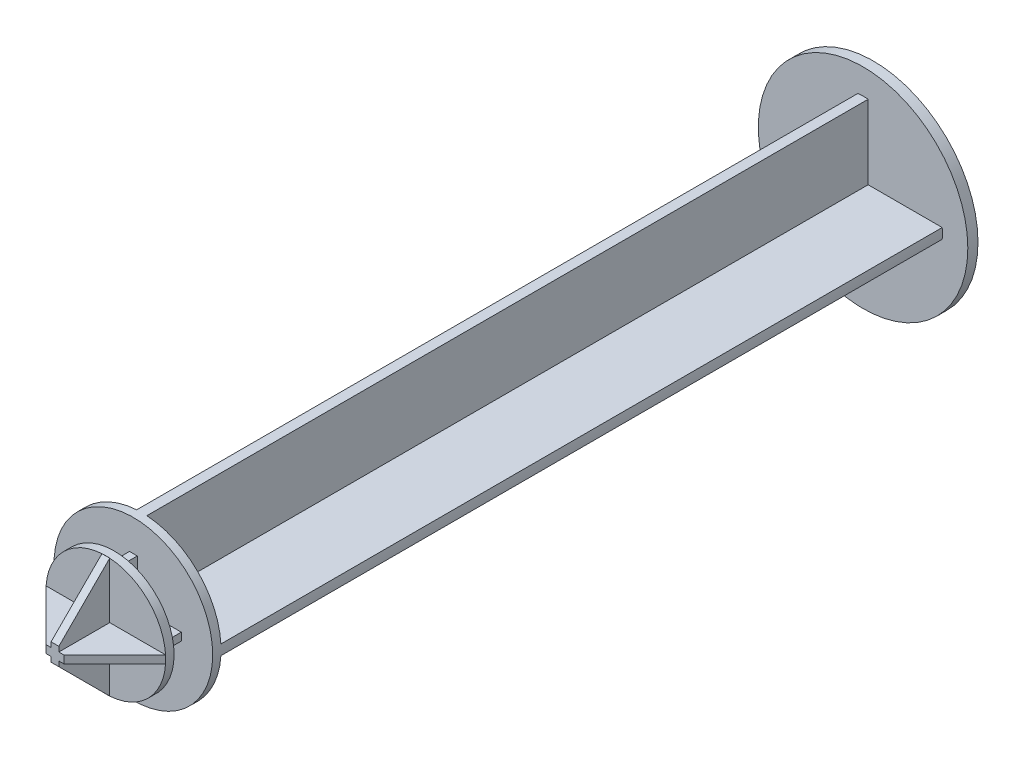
from build123d import *

# Parameters (mm, degrees)
ESQUISSE1_R    = 17.5
DISQUE_1_DEPTH = 1.7
TIGE_DEPTH     = 120.5
ESQUISSE3_R    = 13.25
DISQUE_2_DEPTH = 1.4
CROIX_1_DEPTH  = 3.2
ESQUISSE5_R    = 10
DISQUE_3_DEPTH = 1.4
CROIX_2_DEPTH  = 8.5
EMBOUT_ANGLE   = 45


with BuildPart() as part:
    # Esquisse1 → DISQUE 1 (new body)
    with BuildSketch(Plane.XY):
        Circle(ESQUISSE1_R)
    extrude(amount=DISQUE_1_DEPTH)

    # Esquisse2 → TIGE (add)
    with BuildSketch(Plane.XY.offset(1.7)):
        with BuildLine():
            Line((-0.85, 13.222707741), (-0.85, 0.85))
            Line((-0.85, 0.85), (-13.222707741, 0.85))
            ThreePointArc((-13.222707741, 0.85), (-13.25, 0), (-13.222707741, -0.85))
            Line((-13.222707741, -0.85), (-0.85, -0.85))
            Line((-0.85, -0.85), (-0.85, -13.222707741))
            ThreePointArc((-0.85, -13.222707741), (0, -13.25), (0.85, -13.222707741))
            Line((0.85, -13.222707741), (0.85, -0.85))
            Line((0.85, -0.85), (13.222707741, -0.85))
            ThreePointArc((13.222707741, -0.85), (13.25, 0), (13.222707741, 0.85))
            Line((13.222707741, 0.85), (0.85, 0.85))
            Line((0.85, 0.85), (0.85, 13.222707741))
            ThreePointArc((0.85, 13.222707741), (0, 13.25), (-0.85, 13.222707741))
        make_face()
    extrude(amount=TIGE_DEPTH)

    # Esquisse3 → DISQUE 2 (add)
    with BuildSketch(Plane.XY.offset(122.2)):
        with Locations(Location((0, 0, 0), (0, 0, 176.321895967))):
            Circle(ESQUISSE3_R)
    extrude(amount=DISQUE_2_DEPTH)

    # Esquisse4 → CROIX 1 (add)
    with BuildSketch(Plane.XY.offset(123.6)):
        Polygon((-0.65, 8), (-0.65, 0.65), (-8, 0.65), (-8, -0.65), (-0.65, -0.65), (-0.65, -8), (0.65, -8), (0.65, -0.65), (8, -0.65), (8, 0.65), (0.65, 0.65), (0.65, 8), align=None)
    extrude(amount=CROIX_1_DEPTH)

    # Esquisse5 → DISQUE 3 (add)
    with BuildSketch(Plane.XY.offset(126.8)):
        Circle(ESQUISSE5_R)
    extrude(amount=DISQUE_3_DEPTH)

    # Esquisse6 → CROIX 2 (add)
    with BuildSketch(Plane.XY.offset(128.2)):
        Polygon((-0.65, 9.978852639), (-0.65, 0.65), (-9.978852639, 0.65), (-9.978852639, -0.65), (-0.65, -0.65), (-0.65, -9.978852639), (0.65, -9.978852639), (0.65, -0.65), (9.978852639, -0.65), (9.978852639, 0.65), (0.65, 0.65), (0.65, 9.978852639), align=None)
    extrude(amount=CROIX_2_DEPTH)

    # EMBOUT
    embout_faces = [part.faces().sort_by_distance(p)[0] for p in [
        (0, -9.978852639, 132.45),
        (-9.978852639, 0, 132.45),
        (9.978852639, 0, 132.45),
        (0, 9.978852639, 132.45),
    ]]
    draft(embout_faces, Plane.XY.offset(128.2), EMBOUT_ANGLE)


solid = part.part
